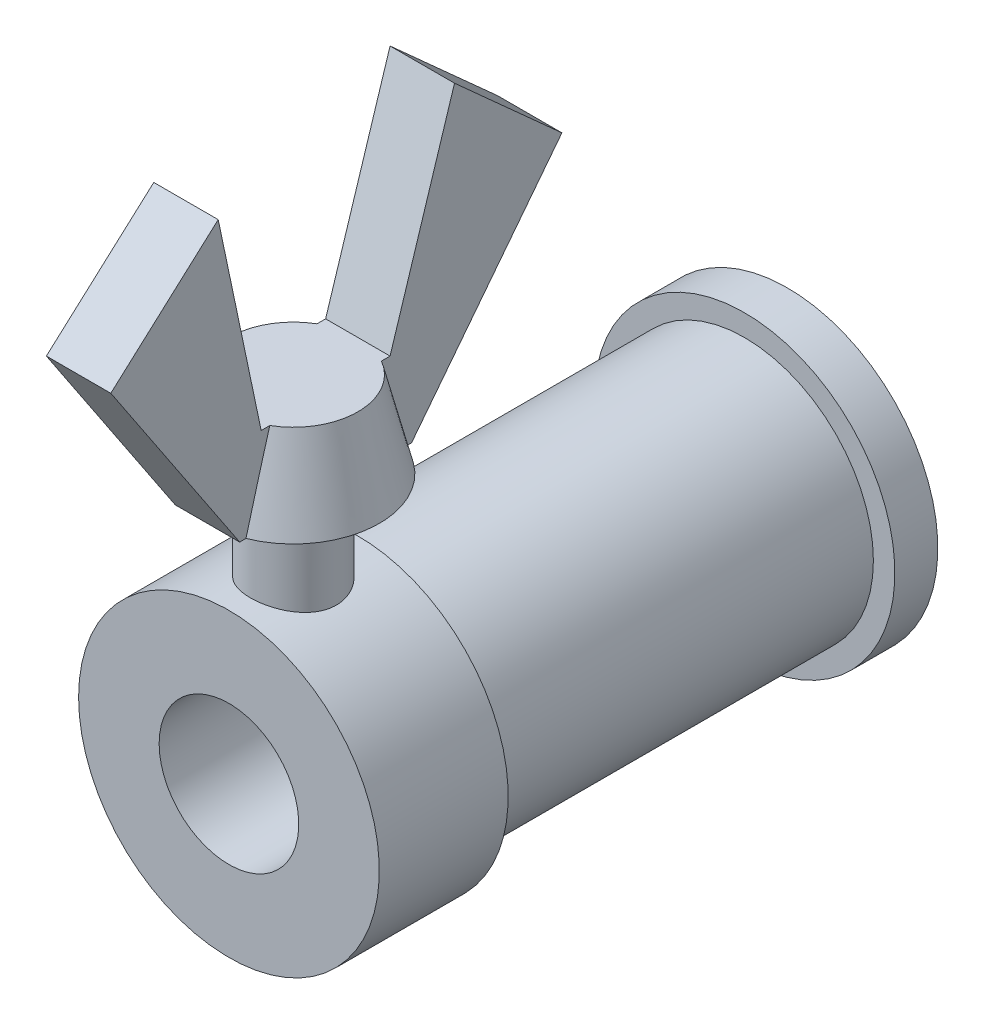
ISO-10303-21;
HEADER;
FILE_DESCRIPTION(('STEP AP214'),'2;1');
FILE_NAME('part.step','',(''),(''),'','','');
FILE_SCHEMA(('AUTOMOTIVE_DESIGN { 1 0 10303 214 1 1 1 1 }'));
ENDSEC;
DATA;
#1=APPLICATION_CONTEXT('core data for automotive mechanical design processes');
#2=APPLICATION_PROTOCOL_DEFINITION('international standard','automotive_design',2000,#1);
#3=PRODUCT_CONTEXT('',#1,'mechanical');
#4=PRODUCT('Part','Part','',(#3));
#5=PRODUCT_RELATED_PRODUCT_CATEGORY('part','',(#4));
#6=PRODUCT_DEFINITION_FORMATION('','',#4);
#7=PRODUCT_DEFINITION_CONTEXT('part definition',#1,'design');
#8=PRODUCT_DEFINITION('design','',#6,#7);
#9=PRODUCT_DEFINITION_SHAPE('','',#8);
#10=(LENGTH_UNIT() NAMED_UNIT(*) SI_UNIT(.MILLI.,.METRE.));
#11=(NAMED_UNIT(*) PLANE_ANGLE_UNIT() SI_UNIT($,.RADIAN.));
#12=(NAMED_UNIT(*) SI_UNIT($,.STERADIAN.) SOLID_ANGLE_UNIT());
#13=UNCERTAINTY_MEASURE_WITH_UNIT(LENGTH_MEASURE(1.E-05),#10,'distance_accuracy_value','');
#14=(GEOMETRIC_REPRESENTATION_CONTEXT(3) GLOBAL_UNCERTAINTY_ASSIGNED_CONTEXT((#13)) GLOBAL_UNIT_ASSIGNED_CONTEXT((#10,
#11,#12)) REPRESENTATION_CONTEXT('',''));
#15=CARTESIAN_POINT('',(0.,0.,0.));
#16=DIRECTION('',(0.,0.,1.));
#17=DIRECTION('',(1.,0.,0.));
#18=AXIS2_PLACEMENT_3D('',#15,#16,#17);
#19=CARTESIAN_POINT('',(0.,15.,23.));
#20=DIRECTION('',(0.,-1.,0.));
#21=DIRECTION('',(0.,0.,1.));
#22=AXIS2_PLACEMENT_3D('',#19,#20,#21);
#23=CONICAL_SURFACE('',#22,3.,0.244978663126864);
#24=CARTESIAN_POINT('',(-1.5,17.8634565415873,24.7225784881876));
#25=CARTESIAN_POINT('',(-1.5,17.7179564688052,24.7707943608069));
#26=CARTESIAN_POINT('',(-1.5,17.5722086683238,24.8182542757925));
#27=CARTESIAN_POINT('',(-1.5,17.2803109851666,24.9119099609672));
#28=CARTESIAN_POINT('',(-1.5,17.13416111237,24.9581057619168));
#29=CARTESIAN_POINT('',(-1.5,16.8415562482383,25.0494799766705));
#30=CARTESIAN_POINT('',(-1.5,16.6951012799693,25.0946584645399));
#31=CARTESIAN_POINT('',(-1.5,16.4019324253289,25.1841702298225));
#32=CARTESIAN_POINT('',(-1.5,16.2552185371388,25.2285035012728));
#33=CARTESIAN_POINT('',(-1.5,15.8148083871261,25.3604319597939));
#34=CARTESIAN_POINT('',(-1.5,15.5207956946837,25.4469706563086));
#35=CARTESIAN_POINT('',(-1.5,14.9321710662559,25.6179995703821));
#36=CARTESIAN_POINT('',(-1.5,14.6375591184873,25.7024897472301));
#37=CARTESIAN_POINT('',(-1.5,14.1572394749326,25.8388644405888));
#38=CARTESIAN_POINT('',(-1.5,13.9716653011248,25.8912200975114));
#39=CARTESIAN_POINT('',(-1.5,13.6003702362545,25.9954030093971));
#40=CARTESIAN_POINT('',(-1.5,13.4146493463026,26.0472302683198));
#41=CARTESIAN_POINT('',(-1.5,12.8572788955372,26.2020403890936));
#42=CARTESIAN_POINT('',(-1.5,12.4854412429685,26.3043460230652));
#43=CARTESIAN_POINT('',(-1.5,11.6318117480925,26.5375328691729));
#44=CARTESIAN_POINT('',(-1.5,11.1498946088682,26.6679546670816));
#45=CARTESIAN_POINT('',(-1.5,10.1856155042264,26.9271461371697));
#46=CARTESIAN_POINT('',(-1.5,9.7032535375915,27.0559158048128));
#47=CARTESIAN_POINT('',(-1.5,8.73827559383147,27.3121964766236));
#48=CARTESIAN_POINT('',(-1.5,8.25565966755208,27.439707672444));
#49=CARTESIAN_POINT('',(-1.5,7.29017561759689,27.6937568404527));
#50=CARTESIAN_POINT('',(-1.5,6.80730749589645,27.8202948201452));
#51=CARTESIAN_POINT('',(-1.5,6.32434773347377,27.9464797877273));
#52=B_SPLINE_CURVE_WITH_KNOTS('',3,(#24,#25,#26,#27,#28,#29,#30,#31,#32,#33,#34,#35,#36,#37,#38,
#39,#40,#41,#42,#43,#44,#45,#46,#47,#48,#49,#50,#51),.UNSPECIFIED.,.F.,.F.,(4,2,2,2,2,2,2,2,2,2,
2,2,2,4),(0.,0.459836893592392,0.919662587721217,1.3794546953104,1.83925004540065,
2.75869016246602,3.67814853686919,4.25660258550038,4.8350522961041,5.99201310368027,
7.48976928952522,8.98752958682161,10.4850581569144,11.982575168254),.UNSPECIFIED.);
#53=CARTESIAN_POINT('',(-1.5,15.,25.5980762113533));
#54=VERTEX_POINT('',#53);
#55=CARTESIAN_POINT('',(-1.5,11.,26.7080992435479));
#56=VERTEX_POINT('',#55);
#57=EDGE_CURVE('E308',#54,#56,#52,.T.);
#58=ORIENTED_EDGE('',*,*,#57,.F.);
#59=CARTESIAN_POINT('',(0.,15.,23.));
#60=DIRECTION('',(0.,-1.,0.));
#61=DIRECTION('',(0.,0.,1.));
#62=AXIS2_PLACEMENT_3D('',#59,#60,#61);
#63=CIRCLE('',#62,3.);
#64=CARTESIAN_POINT('',(-1.5,15.,20.4019237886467));
#65=VERTEX_POINT('',#64);
#66=EDGE_CURVE('E176',#54,#65,#63,.T.);
#67=ORIENTED_EDGE('',*,*,#66,.T.);
#68=CARTESIAN_POINT('',(-1.5,6.32434773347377,18.0535202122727));
#69=CARTESIAN_POINT('',(-1.5,6.80738804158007,18.1797262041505));
#70=CARTESIAN_POINT('',(-1.5,7.29033667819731,18.3062853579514));
#71=CARTESIAN_POINT('',(-1.5,8.25597170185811,18.5603746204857));
#72=CARTESIAN_POINT('',(-1.5,8.73865809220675,18.6879047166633));
#73=CARTESIAN_POINT('',(-1.5,9.70362625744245,18.9441835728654));
#74=CARTESIAN_POINT('',(-1.5,10.1859080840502,19.0729321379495));
#75=CARTESIAN_POINT('',(-1.5,11.1500361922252,19.3320837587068));
#76=CARTESIAN_POINT('',(-1.5,11.6318824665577,19.4624868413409));
#77=CARTESIAN_POINT('',(-1.5,12.5950544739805,19.7255967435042));
#78=CARTESIAN_POINT('',(-1.5,13.0763800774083,19.8583040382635));
#79=CARTESIAN_POINT('',(-1.5,14.038107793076,20.12697047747));
#80=CARTESIAN_POINT('',(-1.5,14.5185099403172,20.2629294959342));
#81=CARTESIAN_POINT('',(-1.5,15.2380729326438,20.4706495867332));
#82=CARTESIAN_POINT('',(-1.5,15.4777770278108,20.5405268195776));
#83=CARTESIAN_POINT('',(-1.5,15.9567027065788,20.6819038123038));
#84=CARTESIAN_POINT('',(-1.5,16.1959242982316,20.7534035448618));
#85=CARTESIAN_POINT('',(-1.5,16.6737573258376,20.898533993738));
#86=CARTESIAN_POINT('',(-1.5,16.9123686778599,20.972164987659));
#87=CARTESIAN_POINT('',(-1.5,17.2696087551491,21.0847837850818));
#88=CARTESIAN_POINT('',(-1.5,17.3885793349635,21.1226865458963));
#89=CARTESIAN_POINT('',(-1.5,17.62624120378,21.199363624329));
#90=CARTESIAN_POINT('',(-1.5,17.7449324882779,21.2381379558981));
#91=CARTESIAN_POINT('',(-1.5,17.8634565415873,21.2774215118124));
#92=B_SPLINE_CURVE_WITH_KNOTS('',3,(#68,#69,#70,#71,#72,#73,#74,#75,#76,#77,#78,#79,#80,#81,#82,
#83,#84,#85,#86,#87,#88,#89,#90,#91),.UNSPECIFIED.,.F.,.F.,(4,2,2,2,2,2,2,2,2,2,2,4),(0.,
1.49776676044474,2.99551418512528,4.49302590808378,5.99056206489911,7.48841083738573,
8.98620167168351,9.73524200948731,10.4842697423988,11.2333954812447,11.6079796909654,
11.9825699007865),.UNSPECIFIED.);
#93=CARTESIAN_POINT('',(-1.5,11.,19.2919007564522));
#94=VERTEX_POINT('',#93);
#95=EDGE_CURVE('E205',#94,#65,#92,.T.);
#96=ORIENTED_EDGE('',*,*,#95,.F.);
#97=CARTESIAN_POINT('',(0.,11.,23.));
#98=DIRECTION('',(0.,-1.,0.));
#99=DIRECTION('',(0.,0.,1.));
#100=AXIS2_PLACEMENT_3D('',#97,#98,#99);
#101=CIRCLE('',#100,4.);
#102=EDGE_CURVE('E174',#56,#94,#101,.T.);
#103=ORIENTED_EDGE('',*,*,#102,.F.);
#104=EDGE_LOOP('',(#58,#67,#96,#103));
#105=FACE_BOUND('',#104,.T.);
#106=ADVANCED_FACE('F14',(#105),#23,.T.);
#107=CARTESIAN_POINT('',(-7.,0.,0.));
#108=DIRECTION('',(0.,0.,1.));
#109=DIRECTION('',(1.,0.,0.));
#110=AXIS2_PLACEMENT_3D('',#107,#108,#109);
#111=PLANE('',#110);
#112=CARTESIAN_POINT('',(0.,0.,0.));
#113=DIRECTION('',(0.,0.,-1.));
#114=DIRECTION('',(-1.,0.,0.));
#115=AXIS2_PLACEMENT_3D('',#112,#113,#114);
#116=CIRCLE('',#115,3.25);
#117=CARTESIAN_POINT('',(-3.25,0.,0.));
#118=VERTEX_POINT('',#117);
#119=EDGE_CURVE('E181',#118,#118,#116,.T.);
#120=ORIENTED_EDGE('',*,*,#119,.F.);
#121=EDGE_LOOP('',(#120));
#122=FACE_BOUND('',#121,.T.);
#123=CARTESIAN_POINT('',(0.,0.,0.));
#124=DIRECTION('',(0.,0.,-1.));
#125=DIRECTION('',(-1.,0.,0.));
#126=AXIS2_PLACEMENT_3D('',#123,#124,#125);
#127=CIRCLE('',#126,7.);
#128=CARTESIAN_POINT('',(-7.,0.,0.));
#129=VERTEX_POINT('',#128);
#130=EDGE_CURVE('E202',#129,#129,#127,.T.);
#131=ORIENTED_EDGE('',*,*,#130,.T.);
#132=EDGE_LOOP('',(#131));
#133=FACE_BOUND('',#132,.T.);
#134=ADVANCED_FACE('F16',(#122,#133),#111,.F.);
#135=CARTESIAN_POINT('',(0.,0.,-34.));
#136=DIRECTION('',(0.,0.,-1.));
#137=DIRECTION('',(-1.,0.,0.));
#138=AXIS2_PLACEMENT_3D('',#135,#136,#137);
#139=CYLINDRICAL_SURFACE('',#138,7.);
#140=ORIENTED_EDGE('',*,*,#130,.F.);
#141=EDGE_LOOP('',(#140));
#142=FACE_BOUND('',#141,.T.);
#143=CARTESIAN_POINT('',(0.,0.,2.));
#144=DIRECTION('',(0.,0.,-1.));
#145=DIRECTION('',(-1.,0.,0.));
#146=AXIS2_PLACEMENT_3D('',#143,#144,#145);
#147=CIRCLE('',#146,7.);
#148=CARTESIAN_POINT('',(-7.,0.,2.));
#149=VERTEX_POINT('',#148);
#150=EDGE_CURVE('E199',#149,#149,#147,.T.);
#151=ORIENTED_EDGE('',*,*,#150,.T.);
#152=EDGE_LOOP('',(#151));
#153=FACE_BOUND('',#152,.T.);
#154=ADVANCED_FACE('F254',(#142,#153),#139,.T.);
#155=CARTESIAN_POINT('',(-6.,0.,2.));
#156=DIRECTION('',(0.,0.,-1.));
#157=DIRECTION('',(-1.,0.,0.));
#158=AXIS2_PLACEMENT_3D('',#155,#156,#157);
#159=PLANE('',#158);
#160=ORIENTED_EDGE('',*,*,#150,.F.);
#161=EDGE_LOOP('',(#160));
#162=FACE_BOUND('',#161,.T.);
#163=CARTESIAN_POINT('',(0.,0.,2.));
#164=DIRECTION('',(0.,0.,-1.));
#165=DIRECTION('',(-1.,0.,0.));
#166=AXIS2_PLACEMENT_3D('',#163,#164,#165);
#167=CIRCLE('',#166,6.);
#168=CARTESIAN_POINT('',(-6.,0.,2.));
#169=VERTEX_POINT('',#168);
#170=EDGE_CURVE('E196',#169,#169,#167,.T.);
#171=ORIENTED_EDGE('',*,*,#170,.T.);
#172=EDGE_LOOP('',(#171));
#173=FACE_BOUND('',#172,.T.);
#174=ADVANCED_FACE('F434',(#162,#173),#159,.F.);
#175=CARTESIAN_POINT('',(0.,0.,-34.));
#176=DIRECTION('',(0.,0.,-1.));
#177=DIRECTION('',(-1.,0.,0.));
#178=AXIS2_PLACEMENT_3D('',#175,#176,#177);
#179=CYLINDRICAL_SURFACE('',#178,6.);
#180=ORIENTED_EDGE('',*,*,#170,.F.);
#181=EDGE_LOOP('',(#180));
#182=FACE_BOUND('',#181,.T.);
#183=CARTESIAN_POINT('',(0.,0.,20.));
#184=DIRECTION('',(0.,0.,-1.));
#185=DIRECTION('',(-1.,0.,0.));
#186=AXIS2_PLACEMENT_3D('',#183,#184,#185);
#187=CIRCLE('',#186,6.);
#188=CARTESIAN_POINT('',(-6.,0.,20.));
#189=VERTEX_POINT('',#188);
#190=EDGE_CURVE('E193',#189,#189,#187,.T.);
#191=ORIENTED_EDGE('',*,*,#190,.T.);
#192=EDGE_LOOP('',(#191));
#193=FACE_BOUND('',#192,.T.);
#194=ADVANCED_FACE('F425',(#182,#193),#179,.T.);
#195=CARTESIAN_POINT('',(-7.,0.,20.));
#196=DIRECTION('',(0.,0.,1.));
#197=DIRECTION('',(1.,0.,0.));
#198=AXIS2_PLACEMENT_3D('',#195,#196,#197);
#199=PLANE('',#198);
#200=ORIENTED_EDGE('',*,*,#190,.F.);
#201=EDGE_LOOP('',(#200));
#202=FACE_BOUND('',#201,.T.);
#203=CARTESIAN_POINT('',(0.,0.,20.));
#204=DIRECTION('',(0.,0.,-1.));
#205=DIRECTION('',(-1.,0.,0.));
#206=AXIS2_PLACEMENT_3D('',#203,#204,#205);
#207=CIRCLE('',#206,7.);
#208=CARTESIAN_POINT('',(-7.,0.,20.));
#209=VERTEX_POINT('',#208);
#210=EDGE_CURVE('E190',#209,#209,#207,.T.);
#211=ORIENTED_EDGE('',*,*,#210,.T.);
#212=EDGE_LOOP('',(#211));
#213=FACE_BOUND('',#212,.T.);
#214=ADVANCED_FACE('F244',(#202,#213),#199,.F.);
#215=CARTESIAN_POINT('',(0.,0.,-34.));
#216=DIRECTION('',(0.,0.,-1.));
#217=DIRECTION('',(-1.,0.,0.));
#218=AXIS2_PLACEMENT_3D('',#215,#216,#217);
#219=CYLINDRICAL_SURFACE('',#218,7.);
#220=CARTESIAN_POINT('',(0.,7.,25.));
#221=CARTESIAN_POINT('',(-0.109954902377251,6.99999869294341,24.9999980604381));
#222=CARTESIAN_POINT('',(-0.219929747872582,6.99738417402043,24.9909022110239));
#223=CARTESIAN_POINT('',(-0.43669199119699,6.98720905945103,24.9548357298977));
#224=CARTESIAN_POINT('',(-0.543478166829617,6.97964659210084,24.9278583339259));
#225=CARTESIAN_POINT('',(-0.750704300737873,6.96040691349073,24.8569919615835));
#226=CARTESIAN_POINT('',(-0.851152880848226,6.94873544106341,24.8131265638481));
#227=CARTESIAN_POINT('',(-1.04326876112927,6.92249978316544,24.7098220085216));
#228=CARTESIAN_POINT('',(-1.13493514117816,6.90793529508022,24.6503812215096));
#229=CARTESIAN_POINT('',(-1.30929444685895,6.8770473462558,24.5159649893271));
#230=CARTESIAN_POINT('',(-1.39172372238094,6.8606904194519,24.4406552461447));
#231=CARTESIAN_POINT('',(-1.54297135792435,6.82826734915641,24.2773522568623));
#232=CARTESIAN_POINT('',(-1.61178767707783,6.81220124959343,24.1893571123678));
#233=CARTESIAN_POINT('',(-1.73519790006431,6.78183014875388,24.0010064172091));
#234=CARTESIAN_POINT('',(-1.78947821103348,6.76756702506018,23.9004380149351));
#235=CARTESIAN_POINT('',(-1.8802517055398,6.74291343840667,23.6911279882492));
#236=CARTESIAN_POINT('',(-1.91674871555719,6.73252214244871,23.5823881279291));
#237=CARTESIAN_POINT('',(-1.96998433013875,6.71713608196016,23.3627652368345));
#238=CARTESIAN_POINT('',(-1.9872055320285,6.71200978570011,23.2520086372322));
#239=CARTESIAN_POINT('',(-2.00290667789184,6.70734208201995,23.0290688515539));
#240=CARTESIAN_POINT('',(-2.00139069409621,6.70779946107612,22.9168859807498));
#241=CARTESIAN_POINT('',(-1.98004134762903,6.71413034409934,22.6981313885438));
#242=CARTESIAN_POINT('',(-1.96080325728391,6.71982782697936,22.5914956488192));
#243=CARTESIAN_POINT('',(-1.90551386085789,6.73571348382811,22.3830327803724));
#244=CARTESIAN_POINT('',(-1.8694610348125,6.74590206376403,22.2812060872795));
#245=CARTESIAN_POINT('',(-1.78110681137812,6.7697686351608,22.0837537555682));
#246=CARTESIAN_POINT('',(-1.72860551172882,6.78348916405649,21.9882229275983));
#247=CARTESIAN_POINT('',(-1.60898379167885,6.81285216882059,21.8071234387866));
#248=CARTESIAN_POINT('',(-1.54186011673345,6.82849507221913,21.7215570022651));
#249=CARTESIAN_POINT('',(-1.39190399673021,6.86066250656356,21.5594276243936));
#250=CARTESIAN_POINT('',(-1.30857487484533,6.87719804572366,21.4833255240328));
#251=CARTESIAN_POINT('',(-1.13013228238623,6.90876247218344,21.3460739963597));
#252=CARTESIAN_POINT('',(-1.03501820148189,6.92379128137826,21.2849253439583));
#253=CARTESIAN_POINT('',(-0.834923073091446,6.95076528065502,21.179071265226));
#254=CARTESIAN_POINT('',(-0.729889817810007,6.96269275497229,21.1344597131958));
#255=CARTESIAN_POINT('',(-0.513393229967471,6.98199251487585,21.0636661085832));
#256=CARTESIAN_POINT('',(-0.401931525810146,6.98936594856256,21.0374794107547));
#257=CARTESIAN_POINT('',(-0.179666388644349,6.99854874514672,21.0050267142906));
#258=CARTESIAN_POINT('',(-0.0689613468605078,7.00053272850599,20.998135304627));
#259=CARTESIAN_POINT('',(0.152026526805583,6.99922084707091,21.002727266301));
#260=CARTESIAN_POINT('',(0.262309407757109,6.99592561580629,21.0142084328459));
#261=CARTESIAN_POINT('',(0.477018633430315,6.98453926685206,21.0547104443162));
#262=CARTESIAN_POINT('',(0.581518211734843,6.97654613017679,21.0833731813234));
#263=CARTESIAN_POINT('',(0.784208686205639,6.95667998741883,21.1570005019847));
#264=CARTESIAN_POINT('',(0.882398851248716,6.94480653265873,21.2019669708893));
#265=CARTESIAN_POINT('',(1.07204168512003,6.91809961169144,21.3080233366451));
#266=CARTESIAN_POINT('',(1.16330248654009,6.9032076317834,21.3694411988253));
#267=CARTESIAN_POINT('',(1.33443852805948,6.87217947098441,21.5062525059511));
#268=CARTESIAN_POINT('',(1.41431117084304,6.85604300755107,21.5816491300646));
#269=CARTESIAN_POINT('',(1.56310642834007,6.82368619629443,21.7472093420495));
#270=CARTESIAN_POINT('',(1.63158542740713,6.80748036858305,21.8377752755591));
#271=CARTESIAN_POINT('',(1.75239531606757,6.77738894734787,22.0294625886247));
#272=CARTESIAN_POINT('',(1.8047267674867,6.76350327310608,22.1305836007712));
#273=CARTESIAN_POINT('',(1.89137454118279,6.73978651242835,22.3400912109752));
#274=CARTESIAN_POINT('',(1.92578633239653,6.72993400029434,22.4484357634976));
#275=CARTESIAN_POINT('',(1.97579450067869,6.71542456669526,22.6697099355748));
#276=CARTESIAN_POINT('',(1.99139657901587,6.71076607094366,22.7826381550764));
#277=CARTESIAN_POINT('',(2.00298024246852,6.70731703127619,23.0052960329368));
#278=CARTESIAN_POINT('',(1.99968027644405,6.70831160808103,23.1149855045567));
#279=CARTESIAN_POINT('',(1.97524710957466,6.71554597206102,23.3321747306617));
#280=CARTESIAN_POINT('',(1.95411450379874,6.72178558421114,23.4396745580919));
#281=CARTESIAN_POINT('',(1.89505968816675,6.73866977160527,23.6483783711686));
#282=CARTESIAN_POINT('',(1.85731091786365,6.74926877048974,23.7496353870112));
#283=CARTESIAN_POINT('',(1.76622949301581,6.77367302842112,23.9444587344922));
#284=CARTESIAN_POINT('',(1.71289408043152,6.78747885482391,24.0380237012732));
#285=CARTESIAN_POINT('',(1.59006546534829,6.81731668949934,24.2181835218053));
#286=CARTESIAN_POINT('',(1.52009227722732,6.83340763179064,24.304441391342));
#287=CARTESIAN_POINT('',(1.36685984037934,6.86569845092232,24.4642238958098));
#288=CARTESIAN_POINT('',(1.28359725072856,6.88189835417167,24.5377453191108));
#289=CARTESIAN_POINT('',(1.1035743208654,6.91307959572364,24.6718371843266));
#290=CARTESIAN_POINT('',(1.00652250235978,6.92801901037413,24.7320269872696));
#291=CARTESIAN_POINT('',(0.803250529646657,6.95451395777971,24.835145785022));
#292=CARTESIAN_POINT('',(0.697035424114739,6.96607133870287,24.8780842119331));
#293=CARTESIAN_POINT('',(0.492916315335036,6.98327344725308,24.9408475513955));
#294=CARTESIAN_POINT('',(0.395763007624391,6.98949684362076,24.9629735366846));
#295=CARTESIAN_POINT('',(0.199078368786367,6.99786043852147,24.9925496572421));
#296=CARTESIAN_POINT('',(0.0995473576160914,7.00000118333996,25.0000017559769));
#297=CARTESIAN_POINT('',(0.,7.,25.));
#298=B_SPLINE_CURVE_WITH_KNOTS('',3,(#220,#221,#222,#223,#224,#225,#226,#227,#228,#229,#230,
#231,#232,#233,#234,#235,#236,#237,#238,#239,#240,#241,#242,#243,#244,#245,#246,#247,#248,#249,
#250,#251,#252,#253,#254,#255,#256,#257,#258,#259,#260,#261,#262,#263,#264,#265,#266,#267,#268,
#269,#270,#271,#272,#273,#274,#275,#276,#277,#278,#279,#280,#281,#282,#283,#284,#285,#286,#287,
#288,#289,#290,#291,#292,#293,#294,#295,#296,#297),.UNSPECIFIED.,.T.,.F.,(4,2,2,2,2,2,2,2,2,2,2,
2,2,2,2,2,2,2,2,2,2,2,2,2,2,2,2,2,2,2,2,2,2,2,2,2,2,2,4),(0.,0.329499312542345,
0.659123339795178,0.988288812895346,1.31748873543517,1.65447811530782,1.99151797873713,
2.33533075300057,2.67906951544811,3.0139950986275,3.34884789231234,3.67284785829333,
3.99687711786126,4.32500803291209,4.65321205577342,4.99378500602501,5.33437560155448,
5.67687101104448,6.01928004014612,6.350454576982,6.68158937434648,7.00605140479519,
7.33055096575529,7.66207525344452,7.99367503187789,8.33612104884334,8.67855514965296,
9.01914573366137,9.35963305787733,9.68726681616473,10.0148896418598,10.3391709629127,
10.6635096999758,10.9986765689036,11.3339278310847,11.6777797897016,12.0214434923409,
12.3197946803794,12.6181059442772),.UNSPECIFIED.);
#299=CARTESIAN_POINT('',(0.,7.,25.));
#300=VERTEX_POINT('',#299);
#301=EDGE_CURVE('E180',#300,#300,#298,.T.);
#302=ORIENTED_EDGE('',*,*,#301,.T.);
#303=EDGE_LOOP('',(#302));
#304=FACE_BOUND('',#303,.T.);
#305=ORIENTED_EDGE('',*,*,#210,.F.);
#306=EDGE_LOOP('',(#305));
#307=FACE_BOUND('',#306,.T.);
#308=CARTESIAN_POINT('',(0.,0.,26.));
#309=DIRECTION('',(0.,0.,-1.));
#310=DIRECTION('',(-1.,0.,0.));
#311=AXIS2_PLACEMENT_3D('',#308,#309,#310);
#312=CIRCLE('',#311,7.);
#313=CARTESIAN_POINT('',(-7.,0.,26.));
#314=VERTEX_POINT('',#313);
#315=EDGE_CURVE('E187',#314,#314,#312,.T.);
#316=ORIENTED_EDGE('',*,*,#315,.T.);
#317=EDGE_LOOP('',(#316));
#318=FACE_BOUND('',#317,.T.);
#319=ADVANCED_FACE('F219',(#304,#307,#318),#219,.T.);
#320=CARTESIAN_POINT('',(-3.25,0.,26.));
#321=DIRECTION('',(0.,0.,-1.));
#322=DIRECTION('',(-1.,0.,0.));
#323=AXIS2_PLACEMENT_3D('',#320,#321,#322);
#324=PLANE('',#323);
#325=ORIENTED_EDGE('',*,*,#315,.F.);
#326=EDGE_LOOP('',(#325));
#327=FACE_BOUND('',#326,.T.);
#328=CARTESIAN_POINT('',(0.,0.,26.));
#329=DIRECTION('',(0.,0.,-1.));
#330=DIRECTION('',(-1.,0.,0.));
#331=AXIS2_PLACEMENT_3D('',#328,#329,#330);
#332=CIRCLE('',#331,3.25);
#333=CARTESIAN_POINT('',(-3.25,0.,26.));
#334=VERTEX_POINT('',#333);
#335=EDGE_CURVE('E184',#334,#334,#332,.T.);
#336=ORIENTED_EDGE('',*,*,#335,.T.);
#337=EDGE_LOOP('',(#336));
#338=FACE_BOUND('',#337,.T.);
#339=ADVANCED_FACE('F236',(#327,#338),#324,.F.);
#340=CARTESIAN_POINT('',(0.,0.,-34.));
#341=DIRECTION('',(0.,0.,-1.));
#342=DIRECTION('',(-1.,0.,0.));
#343=AXIS2_PLACEMENT_3D('',#340,#341,#342);
#344=CYLINDRICAL_SURFACE('',#343,3.25);
#345=ORIENTED_EDGE('',*,*,#335,.F.);
#346=EDGE_LOOP('',(#345));
#347=FACE_BOUND('',#346,.T.);
#348=ORIENTED_EDGE('',*,*,#119,.T.);
#349=EDGE_LOOP('',(#348));
#350=FACE_BOUND('',#349,.T.);
#351=ADVANCED_FACE('F229',(#347,#350),#344,.F.);
#352=CARTESIAN_POINT('',(0.,-40.,23.));
#353=DIRECTION('',(0.,-1.,0.));
#354=DIRECTION('',(0.,0.,1.));
#355=AXIS2_PLACEMENT_3D('',#352,#353,#354);
#356=CYLINDRICAL_SURFACE('',#355,2.);
#357=CARTESIAN_POINT('',(0.,11.,23.));
#358=DIRECTION('',(0.,-1.,0.));
#359=DIRECTION('',(0.,0.,1.));
#360=AXIS2_PLACEMENT_3D('',#357,#358,#359);
#361=CIRCLE('',#360,2.);
#362=CARTESIAN_POINT('',(0.,11.,25.));
#363=VERTEX_POINT('',#362);
#364=EDGE_CURVE('E177',#363,#363,#361,.T.);
#365=ORIENTED_EDGE('',*,*,#364,.T.);
#366=EDGE_LOOP('',(#365));
#367=FACE_BOUND('',#366,.T.);
#368=ORIENTED_EDGE('',*,*,#301,.F.);
#369=EDGE_LOOP('',(#368));
#370=FACE_BOUND('',#369,.T.);
#371=ADVANCED_FACE('F223',(#367,#370),#356,.T.);
#372=CARTESIAN_POINT('',(0.,11.,19.));
#373=DIRECTION('',(0.,1.,0.));
#374=DIRECTION('',(0.,0.,-1.));
#375=AXIS2_PLACEMENT_3D('',#372,#373,#374);
#376=PLANE('',#375);
#377=ORIENTED_EDGE('',*,*,#364,.F.);
#378=EDGE_LOOP('',(#377));
#379=FACE_BOUND('',#378,.T.);
#380=CARTESIAN_POINT('',(1.5,11.,19.2919007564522));
#381=VERTEX_POINT('',#380);
#382=CARTESIAN_POINT('',(1.5,11.,26.7080992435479));
#383=VERTEX_POINT('',#382);
#384=EDGE_CURVE('E116',#381,#383,#101,.T.);
#385=ORIENTED_EDGE('',*,*,#384,.T.);
#386=DIRECTION('',(0.,0.,1.));
#387=VECTOR('',#386,1.);
#388=CARTESIAN_POINT('',(1.5,11.,19.));
#389=LINE('',#388,#387);
#390=CARTESIAN_POINT('',(1.5,11.,27.));
#391=VERTEX_POINT('',#390);
#392=EDGE_CURVE('E132',#383,#391,#389,.T.);
#393=ORIENTED_EDGE('',*,*,#392,.T.);
#394=DIRECTION('',(1.,0.,0.));
#395=VECTOR('',#394,1.);
#396=CARTESIAN_POINT('',(-1.5,11.,27.));
#397=LINE('',#396,#395);
#398=CARTESIAN_POINT('',(-1.5,11.,27.));
#399=VERTEX_POINT('',#398);
#400=EDGE_CURVE('E167',#399,#391,#397,.T.);
#401=ORIENTED_EDGE('',*,*,#400,.F.);
#402=DIRECTION('',(0.,0.,1.));
#403=VECTOR('',#402,1.);
#404=CARTESIAN_POINT('',(-1.5,11.,19.));
#405=LINE('',#404,#403);
#406=EDGE_CURVE('E152',#56,#399,#405,.T.);
#407=ORIENTED_EDGE('',*,*,#406,.F.);
#408=ORIENTED_EDGE('',*,*,#102,.T.);
#409=CARTESIAN_POINT('',(-1.5,11.,19.));
#410=VERTEX_POINT('',#409);
#411=EDGE_CURVE('E149',#410,#94,#405,.T.);
#412=ORIENTED_EDGE('',*,*,#411,.F.);
#413=DIRECTION('',(1.,0.,0.));
#414=VECTOR('',#413,1.);
#415=CARTESIAN_POINT('',(-1.5,11.,19.));
#416=LINE('',#415,#414);
#417=CARTESIAN_POINT('',(1.5,11.,19.));
#418=VERTEX_POINT('',#417);
#419=EDGE_CURVE('E169',#410,#418,#416,.T.);
#420=ORIENTED_EDGE('',*,*,#419,.T.);
#421=EDGE_CURVE('E283',#418,#381,#389,.T.);
#422=ORIENTED_EDGE('',*,*,#421,.T.);
#423=EDGE_LOOP('',(#385,#393,#401,#407,#408,#412,#420,#422));
#424=FACE_BOUND('',#423,.T.);
#425=ADVANCED_FACE('F228',(#379,#424),#376,.F.);
#426=CARTESIAN_POINT('',(0.,15.,20.));
#427=DIRECTION('',(0.,1.,0.));
#428=DIRECTION('',(0.,0.,-1.));
#429=AXIS2_PLACEMENT_3D('',#426,#427,#428);
#430=PLANE('',#429);
#431=CARTESIAN_POINT('',(1.5,15.,20.4019237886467));
#432=VERTEX_POINT('',#431);
#433=CARTESIAN_POINT('',(1.5,15.,25.5980762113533));
#434=VERTEX_POINT('',#433);
#435=EDGE_CURVE('E34',#432,#434,#63,.T.);
#436=ORIENTED_EDGE('',*,*,#435,.F.);
#437=DIRECTION('',(0.,0.,1.));
#438=VECTOR('',#437,1.);
#439=CARTESIAN_POINT('',(1.5,15.,20.));
#440=LINE('',#439,#438);
#441=CARTESIAN_POINT('',(1.5,15.,20.));
#442=VERTEX_POINT('',#441);
#443=EDGE_CURVE('E159',#442,#432,#440,.T.);
#444=ORIENTED_EDGE('',*,*,#443,.F.);
#445=DIRECTION('',(1.,0.,0.));
#446=VECTOR('',#445,1.);
#447=CARTESIAN_POINT('',(-1.5,15.,20.));
#448=LINE('',#447,#446);
#449=CARTESIAN_POINT('',(-1.5,15.,20.));
#450=VERTEX_POINT('',#449);
#451=EDGE_CURVE('E122',#450,#442,#448,.T.);
#452=ORIENTED_EDGE('',*,*,#451,.F.);
#453=DIRECTION('',(0.,0.,1.));
#454=VECTOR('',#453,1.);
#455=CARTESIAN_POINT('',(-1.5,15.,20.));
#456=LINE('',#455,#454);
#457=EDGE_CURVE('E136',#450,#65,#456,.T.);
#458=ORIENTED_EDGE('',*,*,#457,.T.);
#459=ORIENTED_EDGE('',*,*,#66,.F.);
#460=CARTESIAN_POINT('',(-1.5,15.,26.));
#461=VERTEX_POINT('',#460);
#462=EDGE_CURVE('E139',#54,#461,#456,.T.);
#463=ORIENTED_EDGE('',*,*,#462,.T.);
#464=DIRECTION('',(1.,0.,0.));
#465=VECTOR('',#464,1.);
#466=CARTESIAN_POINT('',(-1.5,15.,26.));
#467=LINE('',#466,#465);
#468=CARTESIAN_POINT('',(1.5,15.,26.));
#469=VERTEX_POINT('',#468);
#470=EDGE_CURVE('E161',#461,#469,#467,.T.);
#471=ORIENTED_EDGE('',*,*,#470,.T.);
#472=EDGE_CURVE('E271',#434,#469,#440,.T.);
#473=ORIENTED_EDGE('',*,*,#472,.F.);
#474=EDGE_LOOP('',(#436,#444,#452,#458,#459,#463,#471,#473));
#475=FACE_BOUND('',#474,.T.);
#476=ADVANCED_FACE('F231',(#475),#430,.T.);
#477=ORIENTED_EDGE('',*,*,#435,.T.);
#478=CARTESIAN_POINT('',(1.5,17.8634565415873,24.7225784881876));
#479=CARTESIAN_POINT('',(1.5,17.7179564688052,24.7707943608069));
#480=CARTESIAN_POINT('',(1.5,17.5722086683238,24.8182542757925));
#481=CARTESIAN_POINT('',(1.5,17.2803109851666,24.9119099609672));
#482=CARTESIAN_POINT('',(1.5,17.13416111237,24.9581057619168));
#483=CARTESIAN_POINT('',(1.5,16.8415562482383,25.0494799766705));
#484=CARTESIAN_POINT('',(1.5,16.6951012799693,25.0946584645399));
#485=CARTESIAN_POINT('',(1.5,16.4019324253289,25.1841702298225));
#486=CARTESIAN_POINT('',(1.5,16.2552185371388,25.2285035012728));
#487=CARTESIAN_POINT('',(1.5,15.8148083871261,25.3604319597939));
#488=CARTESIAN_POINT('',(1.5,15.5207956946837,25.4469706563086));
#489=CARTESIAN_POINT('',(1.5,14.9321710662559,25.6179995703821));
#490=CARTESIAN_POINT('',(1.5,14.6375591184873,25.7024897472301));
#491=CARTESIAN_POINT('',(1.5,14.1572394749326,25.8388644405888));
#492=CARTESIAN_POINT('',(1.5,13.9716653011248,25.8912200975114));
#493=CARTESIAN_POINT('',(1.5,13.6003702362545,25.9954030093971));
#494=CARTESIAN_POINT('',(1.5,13.4146493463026,26.0472302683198));
#495=CARTESIAN_POINT('',(1.5,12.8572788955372,26.2020403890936));
#496=CARTESIAN_POINT('',(1.5,12.4854412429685,26.3043460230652));
#497=CARTESIAN_POINT('',(1.5,11.6318117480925,26.5375328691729));
#498=CARTESIAN_POINT('',(1.5,11.1498946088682,26.6679546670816));
#499=CARTESIAN_POINT('',(1.5,10.1856155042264,26.9271461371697));
#500=CARTESIAN_POINT('',(1.5,9.7032535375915,27.0559158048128));
#501=CARTESIAN_POINT('',(1.5,8.73827559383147,27.3121964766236));
#502=CARTESIAN_POINT('',(1.5,8.25565966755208,27.439707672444));
#503=CARTESIAN_POINT('',(1.5,7.29017561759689,27.6937568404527));
#504=CARTESIAN_POINT('',(1.5,6.80730749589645,27.8202948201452));
#505=CARTESIAN_POINT('',(1.5,6.32434773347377,27.9464797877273));
#506=B_SPLINE_CURVE_WITH_KNOTS('',3,(#478,#479,#480,#481,#482,#483,#484,#485,#486,#487,#488,
#489,#490,#491,#492,#493,#494,#495,#496,#497,#498,#499,#500,#501,#502,#503,#504,#505),
.UNSPECIFIED.,.F.,.F.,(4,2,2,2,2,2,2,2,2,2,2,2,2,4),(0.,0.459836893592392,0.919662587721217,
1.3794546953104,1.83925004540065,2.75869016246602,3.67814853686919,4.25660258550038,
4.8350522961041,5.99201310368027,7.48976928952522,8.98752958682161,10.4850581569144,
11.982575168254),.UNSPECIFIED.);
#507=EDGE_CURVE('E9',#434,#383,#506,.T.);
#508=ORIENTED_EDGE('',*,*,#507,.T.);
#509=ORIENTED_EDGE('',*,*,#384,.F.);
#510=CARTESIAN_POINT('',(1.5,6.32434773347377,18.0535202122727));
#511=CARTESIAN_POINT('',(1.5,6.80738804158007,18.1797262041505));
#512=CARTESIAN_POINT('',(1.5,7.29033667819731,18.3062853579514));
#513=CARTESIAN_POINT('',(1.5,8.25597170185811,18.5603746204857));
#514=CARTESIAN_POINT('',(1.5,8.73865809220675,18.6879047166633));
#515=CARTESIAN_POINT('',(1.5,9.70362625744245,18.9441835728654));
#516=CARTESIAN_POINT('',(1.5,10.1859080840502,19.0729321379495));
#517=CARTESIAN_POINT('',(1.5,11.1500361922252,19.3320837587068));
#518=CARTESIAN_POINT('',(1.5,11.6318824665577,19.4624868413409));
#519=CARTESIAN_POINT('',(1.5,12.5950544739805,19.7255967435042));
#520=CARTESIAN_POINT('',(1.5,13.0763800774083,19.8583040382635));
#521=CARTESIAN_POINT('',(1.5,14.038107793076,20.12697047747));
#522=CARTESIAN_POINT('',(1.5,14.5185099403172,20.2629294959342));
#523=CARTESIAN_POINT('',(1.5,15.2380729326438,20.4706495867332));
#524=CARTESIAN_POINT('',(1.5,15.4777770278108,20.5405268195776));
#525=CARTESIAN_POINT('',(1.5,15.9567027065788,20.6819038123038));
#526=CARTESIAN_POINT('',(1.5,16.1959242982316,20.7534035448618));
#527=CARTESIAN_POINT('',(1.5,16.6737573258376,20.898533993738));
#528=CARTESIAN_POINT('',(1.5,16.9123686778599,20.972164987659));
#529=CARTESIAN_POINT('',(1.5,17.2696087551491,21.0847837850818));
#530=CARTESIAN_POINT('',(1.5,17.3885793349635,21.1226865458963));
#531=CARTESIAN_POINT('',(1.5,17.62624120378,21.199363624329));
#532=CARTESIAN_POINT('',(1.5,17.7449324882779,21.2381379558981));
#533=CARTESIAN_POINT('',(1.5,17.8634565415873,21.2774215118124));
#534=B_SPLINE_CURVE_WITH_KNOTS('',3,(#510,#511,#512,#513,#514,#515,#516,#517,#518,#519,#520,
#521,#522,#523,#524,#525,#526,#527,#528,#529,#530,#531,#532,#533),.UNSPECIFIED.,.F.,.F.,(4,2,2,
2,2,2,2,2,2,2,2,4),(0.,1.49776676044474,2.99551418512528,4.49302590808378,5.99056206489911,
7.48841083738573,8.98620167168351,9.73524200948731,10.4842697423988,11.2333954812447,
11.6079796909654,11.9825699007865),.UNSPECIFIED.);
#535=EDGE_CURVE('E28',#381,#432,#534,.T.);
#536=ORIENTED_EDGE('',*,*,#535,.T.);
#537=EDGE_LOOP('',(#477,#508,#509,#536));
#538=FACE_BOUND('',#537,.T.);
#539=ADVANCED_FACE('F250',(#538),#23,.T.);
#540=CARTESIAN_POINT('',(-1.5,11.,19.));
#541=DIRECTION('',(0.,-0.61394061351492,-0.789352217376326));
#542=DIRECTION('',(0.,-0.789352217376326,0.61394061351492));
#543=AXIS2_PLACEMENT_3D('',#540,#541,#542);
#544=PLANE('',#543);
#545=ORIENTED_EDGE('',*,*,#419,.F.);
#546=DIRECTION('',(0.,0.789352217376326,-0.61394061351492));
#547=VECTOR('',#546,1.);
#548=CARTESIAN_POINT('',(-1.5,11.,19.));
#549=LINE('',#548,#547);
#550=CARTESIAN_POINT('',(-1.5,20.,12.));
#551=VERTEX_POINT('',#550);
#552=EDGE_CURVE('E153',#410,#551,#549,.T.);
#553=ORIENTED_EDGE('',*,*,#552,.T.);
#554=DIRECTION('',(1.,0.,0.));
#555=VECTOR('',#554,1.);
#556=CARTESIAN_POINT('',(-1.5,20.,12.));
#557=LINE('',#556,#555);
#558=CARTESIAN_POINT('',(1.5,20.,12.));
#559=VERTEX_POINT('',#558);
#560=EDGE_CURVE('E117',#551,#559,#557,.T.);
#561=ORIENTED_EDGE('',*,*,#560,.T.);
#562=DIRECTION('',(0.,0.789352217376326,-0.61394061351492));
#563=VECTOR('',#562,1.);
#564=CARTESIAN_POINT('',(1.5,11.,19.));
#565=LINE('',#564,#563);
#566=EDGE_CURVE('E130',#418,#559,#565,.T.);
#567=ORIENTED_EDGE('',*,*,#566,.F.);
#568=EDGE_LOOP('',(#545,#553,#561,#567));
#569=FACE_BOUND('',#568,.T.);
#570=ADVANCED_FACE('F259',(#569),#544,.T.);
#571=CARTESIAN_POINT('',(-1.5,20.,12.));
#572=DIRECTION('',(0.,0.743294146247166,-0.66896473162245));
#573=DIRECTION('',(0.,-0.66896473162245,-0.743294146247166));
#574=AXIS2_PLACEMENT_3D('',#571,#572,#573);
#575=PLANE('',#574);
#576=ORIENTED_EDGE('',*,*,#560,.F.);
#577=DIRECTION('',(0.,0.66896473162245,0.743294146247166));
#578=VECTOR('',#577,1.);
#579=CARTESIAN_POINT('',(-1.5,20.,12.));
#580=LINE('',#579,#578);
#581=CARTESIAN_POINT('',(-1.5,24.5,17.));
#582=VERTEX_POINT('',#581);
#583=EDGE_CURVE('E112',#551,#582,#580,.T.);
#584=ORIENTED_EDGE('',*,*,#583,.T.);
#585=DIRECTION('',(1.,0.,0.));
#586=VECTOR('',#585,1.);
#587=CARTESIAN_POINT('',(-1.5,24.5,17.));
#588=LINE('',#587,#586);
#589=CARTESIAN_POINT('',(1.5,24.5,17.));
#590=VERTEX_POINT('',#589);
#591=EDGE_CURVE('E105',#582,#590,#588,.T.);
#592=ORIENTED_EDGE('',*,*,#591,.T.);
#593=DIRECTION('',(0.,0.66896473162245,0.743294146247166));
#594=VECTOR('',#593,1.);
#595=CARTESIAN_POINT('',(1.5,20.,12.));
#596=LINE('',#595,#594);
#597=EDGE_CURVE('E109',#559,#590,#596,.T.);
#598=ORIENTED_EDGE('',*,*,#597,.F.);
#599=EDGE_LOOP('',(#576,#584,#592,#598));
#600=FACE_BOUND('',#599,.T.);
#601=ADVANCED_FACE('F107',(#600),#575,.T.);
#602=CARTESIAN_POINT('',(1.5,11.,21.2631578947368));
#603=DIRECTION('',(1.,0.,0.));
#604=DIRECTION('',(0.,0.,-1.));
#605=AXIS2_PLACEMENT_3D('',#602,#603,#604);
#606=PLANE('',#605);
#607=ORIENTED_EDGE('',*,*,#535,.F.);
#608=ORIENTED_EDGE('',*,*,#421,.F.);
#609=ORIENTED_EDGE('',*,*,#566,.T.);
#610=ORIENTED_EDGE('',*,*,#597,.T.);
#611=DIRECTION('',(0.,0.953582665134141,-0.301131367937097));
#612=VECTOR('',#611,1.);
#613=CARTESIAN_POINT('',(1.5,15.,20.));
#614=LINE('',#613,#612);
#615=EDGE_CURVE('E120',#442,#590,#614,.T.);
#616=ORIENTED_EDGE('',*,*,#615,.F.);
#617=ORIENTED_EDGE('',*,*,#443,.T.);
#618=EDGE_LOOP('',(#607,#608,#609,#610,#616,#617));
#619=FACE_BOUND('',#618,.T.);
#620=ADVANCED_FACE('F127',(#619),#606,.T.);
#621=CARTESIAN_POINT('',(-1.5,15.,20.));
#622=DIRECTION('',(0.,-0.301131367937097,-0.953582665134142));
#623=DIRECTION('',(0.,-0.953582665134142,0.301131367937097));
#624=AXIS2_PLACEMENT_3D('',#621,#622,#623);
#625=PLANE('',#624);
#626=ORIENTED_EDGE('',*,*,#591,.F.);
#627=DIRECTION('',(0.,0.953582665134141,-0.301131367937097));
#628=VECTOR('',#627,1.);
#629=CARTESIAN_POINT('',(-1.5,15.,20.));
#630=LINE('',#629,#628);
#631=EDGE_CURVE('E157',#450,#582,#630,.T.);
#632=ORIENTED_EDGE('',*,*,#631,.F.);
#633=ORIENTED_EDGE('',*,*,#451,.T.);
#634=ORIENTED_EDGE('',*,*,#615,.T.);
#635=EDGE_LOOP('',(#626,#632,#633,#634));
#636=FACE_BOUND('',#635,.T.);
#637=ADVANCED_FACE('F121',(#636),#625,.F.);
#638=CARTESIAN_POINT('',(-1.5,11.,21.2631578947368));
#639=DIRECTION('',(1.,0.,0.));
#640=DIRECTION('',(0.,0.,-1.));
#641=AXIS2_PLACEMENT_3D('',#638,#639,#640);
#642=PLANE('',#641);
#643=ORIENTED_EDGE('',*,*,#411,.T.);
#644=ORIENTED_EDGE('',*,*,#95,.T.);
#645=ORIENTED_EDGE('',*,*,#457,.F.);
#646=ORIENTED_EDGE('',*,*,#631,.T.);
#647=ORIENTED_EDGE('',*,*,#583,.F.);
#648=ORIENTED_EDGE('',*,*,#552,.F.);
#649=EDGE_LOOP('',(#643,#644,#645,#646,#647,#648));
#650=FACE_BOUND('',#649,.T.);
#651=ADVANCED_FACE('F314',(#650),#642,.F.);
#652=ORIENTED_EDGE('',*,*,#507,.F.);
#653=ORIENTED_EDGE('',*,*,#472,.T.);
#654=DIRECTION('',(0.,0.978549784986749,0.206010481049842));
#655=VECTOR('',#654,1.);
#656=CARTESIAN_POINT('',(1.5,15.,26.));
#657=LINE('',#656,#655);
#658=CARTESIAN_POINT('',(1.5,24.5,28.));
#659=VERTEX_POINT('',#658);
#660=EDGE_CURVE('E274',#469,#659,#657,.T.);
#661=ORIENTED_EDGE('',*,*,#660,.T.);
#662=DIRECTION('',(0.,-0.66896473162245,0.743294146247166));
#663=VECTOR('',#662,1.);
#664=CARTESIAN_POINT('',(1.5,24.5,28.));
#665=LINE('',#664,#663);
#666=CARTESIAN_POINT('',(1.5,20.,33.));
#667=VERTEX_POINT('',#666);
#668=EDGE_CURVE('E278',#659,#667,#665,.T.);
#669=ORIENTED_EDGE('',*,*,#668,.T.);
#670=DIRECTION('',(0.,0.832050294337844,0.554700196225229));
#671=VECTOR('',#670,1.);
#672=CARTESIAN_POINT('',(1.5,11.,27.));
#673=LINE('',#672,#671);
#674=EDGE_CURVE('E281',#391,#667,#673,.T.);
#675=ORIENTED_EDGE('',*,*,#674,.F.);
#676=ORIENTED_EDGE('',*,*,#392,.F.);
#677=EDGE_LOOP('',(#652,#653,#661,#669,#675,#676));
#678=FACE_BOUND('',#677,.T.);
#679=ADVANCED_FACE('F292',(#678),#606,.T.);
#680=ORIENTED_EDGE('',*,*,#462,.F.);
#681=ORIENTED_EDGE('',*,*,#57,.T.);
#682=ORIENTED_EDGE('',*,*,#406,.T.);
#683=DIRECTION('',(0.,0.832050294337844,0.554700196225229));
#684=VECTOR('',#683,1.);
#685=CARTESIAN_POINT('',(-1.5,11.,27.));
#686=LINE('',#685,#684);
#687=CARTESIAN_POINT('',(-1.5,20.,33.));
#688=VERTEX_POINT('',#687);
#689=EDGE_CURVE('E146',#399,#688,#686,.T.);
#690=ORIENTED_EDGE('',*,*,#689,.T.);
#691=DIRECTION('',(0.,-0.66896473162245,0.743294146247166));
#692=VECTOR('',#691,1.);
#693=CARTESIAN_POINT('',(-1.5,24.5,28.));
#694=LINE('',#693,#692);
#695=CARTESIAN_POINT('',(-1.5,24.5,28.));
#696=VERTEX_POINT('',#695);
#697=EDGE_CURVE('E143',#696,#688,#694,.T.);
#698=ORIENTED_EDGE('',*,*,#697,.F.);
#699=DIRECTION('',(0.,0.978549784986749,0.206010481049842));
#700=VECTOR('',#699,1.);
#701=CARTESIAN_POINT('',(-1.5,15.,26.));
#702=LINE('',#701,#700);
#703=EDGE_CURVE('E140',#461,#696,#702,.T.);
#704=ORIENTED_EDGE('',*,*,#703,.F.);
#705=EDGE_LOOP('',(#680,#681,#682,#690,#698,#704));
#706=FACE_BOUND('',#705,.T.);
#707=ADVANCED_FACE('F299',(#706),#642,.F.);
#708=CARTESIAN_POINT('',(-1.5,11.,27.));
#709=DIRECTION('',(0.,0.554700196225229,-0.832050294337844));
#710=DIRECTION('',(0.,-0.832050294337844,-0.554700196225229));
#711=AXIS2_PLACEMENT_3D('',#708,#709,#710);
#712=PLANE('',#711);
#713=DIRECTION('',(1.,0.,0.));
#714=VECTOR('',#713,1.);
#715=CARTESIAN_POINT('',(-1.5,20.,33.));
#716=LINE('',#715,#714);
#717=EDGE_CURVE('E165',#688,#667,#716,.T.);
#718=ORIENTED_EDGE('',*,*,#717,.F.);
#719=ORIENTED_EDGE('',*,*,#689,.F.);
#720=ORIENTED_EDGE('',*,*,#400,.T.);
#721=ORIENTED_EDGE('',*,*,#674,.T.);
#722=EDGE_LOOP('',(#718,#719,#720,#721));
#723=FACE_BOUND('',#722,.T.);
#724=ADVANCED_FACE('F295',(#723),#712,.F.);
#725=CARTESIAN_POINT('',(-1.5,24.5,28.));
#726=DIRECTION('',(0.,0.743294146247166,0.66896473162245));
#727=DIRECTION('',(0.,0.66896473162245,-0.743294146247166));
#728=AXIS2_PLACEMENT_3D('',#725,#726,#727);
#729=PLANE('',#728);
#730=DIRECTION('',(1.,0.,0.));
#731=VECTOR('',#730,1.);
#732=CARTESIAN_POINT('',(-1.5,24.5,28.));
#733=LINE('',#732,#731);
#734=EDGE_CURVE('E163',#696,#659,#733,.T.);
#735=ORIENTED_EDGE('',*,*,#734,.F.);
#736=ORIENTED_EDGE('',*,*,#697,.T.);
#737=ORIENTED_EDGE('',*,*,#717,.T.);
#738=ORIENTED_EDGE('',*,*,#668,.F.);
#739=EDGE_LOOP('',(#735,#736,#737,#738));
#740=FACE_BOUND('',#739,.T.);
#741=ADVANCED_FACE('F303',(#740),#729,.T.);
#742=CARTESIAN_POINT('',(-1.5,15.,26.));
#743=DIRECTION('',(0.,0.206010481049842,-0.978549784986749));
#744=DIRECTION('',(0.,-0.978549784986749,-0.206010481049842));
#745=AXIS2_PLACEMENT_3D('',#742,#743,#744);
#746=PLANE('',#745);
#747=ORIENTED_EDGE('',*,*,#470,.F.);
#748=ORIENTED_EDGE('',*,*,#703,.T.);
#749=ORIENTED_EDGE('',*,*,#734,.T.);
#750=ORIENTED_EDGE('',*,*,#660,.F.);
#751=EDGE_LOOP('',(#747,#748,#749,#750));
#752=FACE_BOUND('',#751,.T.);
#753=ADVANCED_FACE('F307',(#752),#746,.T.);
#754=CLOSED_SHELL('',(#106,#134,#154,#174,#194,#214,#319,#339,#351,#371,#425,#476,#539,#570,
#601,#620,#637,#651,#679,#707,#724,#741,#753));
#755=MANIFOLD_SOLID_BREP('B1',#754);
#756=ADVANCED_BREP_SHAPE_REPRESENTATION('',(#18,#755),#14);
#757=SHAPE_DEFINITION_REPRESENTATION(#9,#756);
ENDSEC;
END-ISO-10303-21;
